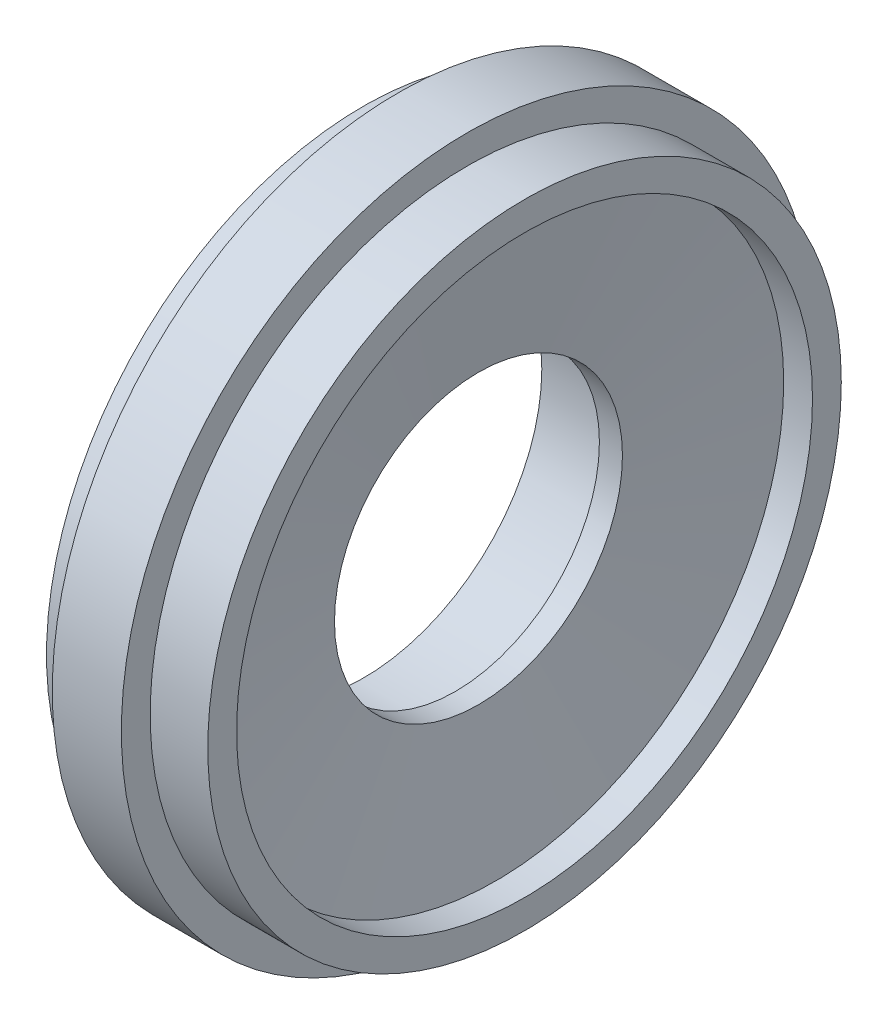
ISO-10303-21;
HEADER;
FILE_DESCRIPTION(('STEP AP214'),'2;1');
FILE_NAME('part.step','',(''),(''),'','','');
FILE_SCHEMA(('AUTOMOTIVE_DESIGN { 1 0 10303 214 1 1 1 1 }'));
ENDSEC;
DATA;
#1=APPLICATION_CONTEXT('core data for automotive mechanical design processes');
#2=APPLICATION_PROTOCOL_DEFINITION('international standard','automotive_design',2000,#1);
#3=PRODUCT_CONTEXT('',#1,'mechanical');
#4=PRODUCT('Part','Part','',(#3));
#5=PRODUCT_RELATED_PRODUCT_CATEGORY('part','',(#4));
#6=PRODUCT_DEFINITION_FORMATION('','',#4);
#7=PRODUCT_DEFINITION_CONTEXT('part definition',#1,'design');
#8=PRODUCT_DEFINITION('design','',#6,#7);
#9=PRODUCT_DEFINITION_SHAPE('','',#8);
#10=(LENGTH_UNIT() NAMED_UNIT(*) SI_UNIT(.MILLI.,.METRE.));
#11=(NAMED_UNIT(*) PLANE_ANGLE_UNIT() SI_UNIT($,.RADIAN.));
#12=(NAMED_UNIT(*) SI_UNIT($,.STERADIAN.) SOLID_ANGLE_UNIT());
#13=UNCERTAINTY_MEASURE_WITH_UNIT(LENGTH_MEASURE(1.E-05),#10,'distance_accuracy_value','');
#14=(GEOMETRIC_REPRESENTATION_CONTEXT(3) GLOBAL_UNCERTAINTY_ASSIGNED_CONTEXT((#13)) GLOBAL_UNIT_ASSIGNED_CONTEXT((#10,
#11,#12)) REPRESENTATION_CONTEXT('',''));
#15=CARTESIAN_POINT('',(0.,0.,0.));
#16=DIRECTION('',(0.,0.,1.));
#17=DIRECTION('',(1.,0.,0.));
#18=AXIS2_PLACEMENT_3D('',#15,#16,#17);
#19=CARTESIAN_POINT('',(16.,-21.6421009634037,0.));
#20=DIRECTION('',(-1.,0.,0.));
#21=DIRECTION('',(0.,0.,1.));
#22=AXIS2_PLACEMENT_3D('',#19,#20,#21);
#23=PLANE('',#22);
#24=CARTESIAN_POINT('',(16.,0.,0.));
#25=DIRECTION('',(1.,0.,0.));
#26=DIRECTION('',(0.,0.,-1.));
#27=AXIS2_PLACEMENT_3D('',#24,#25,#26);
#28=CIRCLE('',#27,25.);
#29=CARTESIAN_POINT('',(16.,0.,-25.));
#30=VERTEX_POINT('',#29);
#31=EDGE_CURVE('E10',#30,#30,#28,.T.);
#32=ORIENTED_EDGE('',*,*,#31,.T.);
#33=EDGE_LOOP('',(#32));
#34=FACE_BOUND('',#33,.T.);
#35=CARTESIAN_POINT('',(16.,0.,0.));
#36=DIRECTION('',(1.,0.,0.));
#37=DIRECTION('',(0.,0.,-1.));
#38=AXIS2_PLACEMENT_3D('',#35,#36,#37);
#39=CIRCLE('',#38,31.);
#40=CARTESIAN_POINT('',(16.,0.,-31.));
#41=VERTEX_POINT('',#40);
#42=EDGE_CURVE('E70',#41,#41,#39,.T.);
#43=ORIENTED_EDGE('',*,*,#42,.F.);
#44=EDGE_LOOP('',(#43));
#45=FACE_BOUND('',#44,.T.);
#46=ADVANCED_FACE('F30',(#34,#45),#23,.T.);
#47=CARTESIAN_POINT('',(56.9262114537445,0.,0.));
#48=DIRECTION('',(1.,0.,0.));
#49=DIRECTION('',(0.,0.,-1.));
#50=AXIS2_PLACEMENT_3D('',#47,#48,#49);
#51=CYLINDRICAL_SURFACE('',#50,25.);
#52=CARTESIAN_POINT('',(20.,0.,0.));
#53=DIRECTION('',(1.,0.,0.));
#54=DIRECTION('',(0.,0.,-1.));
#55=AXIS2_PLACEMENT_3D('',#52,#53,#54);
#56=CIRCLE('',#55,25.);
#57=CARTESIAN_POINT('',(20.,0.,-25.));
#58=VERTEX_POINT('',#57);
#59=EDGE_CURVE('E36',#58,#58,#56,.T.);
#60=ORIENTED_EDGE('',*,*,#59,.T.);
#61=EDGE_LOOP('',(#60));
#62=FACE_BOUND('',#61,.T.);
#63=ORIENTED_EDGE('',*,*,#31,.F.);
#64=EDGE_LOOP('',(#63));
#65=FACE_BOUND('',#64,.T.);
#66=ADVANCED_FACE('F78',(#62,#65),#51,.F.);
#67=CARTESIAN_POINT('',(23.,0.,0.));
#68=DIRECTION('',(1.,0.,0.));
#69=DIRECTION('',(0.,0.,-1.));
#70=AXIS2_PLACEMENT_3D('',#67,#68,#69);
#71=CONICAL_SURFACE('',#70,50.,1.45136740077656);
#72=ORIENTED_EDGE('',*,*,#59,.F.);
#73=EDGE_LOOP('',(#72));
#74=FACE_BOUND('',#73,.T.);
#75=CARTESIAN_POINT('',(23.,0.,0.));
#76=DIRECTION('',(1.,0.,0.));
#77=DIRECTION('',(0.,0.,-1.));
#78=AXIS2_PLACEMENT_3D('',#75,#76,#77);
#79=CIRCLE('',#78,50.);
#80=CARTESIAN_POINT('',(23.,0.,-50.));
#81=VERTEX_POINT('',#80);
#82=EDGE_CURVE('E40',#81,#81,#79,.T.);
#83=ORIENTED_EDGE('',*,*,#82,.T.);
#84=EDGE_LOOP('',(#83));
#85=FACE_BOUND('',#84,.T.);
#86=ADVANCED_FACE('F82',(#74,#85),#71,.F.);
#87=CARTESIAN_POINT('',(56.9262114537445,0.,0.));
#88=DIRECTION('',(1.,0.,0.));
#89=DIRECTION('',(0.,0.,-1.));
#90=AXIS2_PLACEMENT_3D('',#87,#88,#89);
#91=CYLINDRICAL_SURFACE('',#90,50.);
#92=ORIENTED_EDGE('',*,*,#82,.F.);
#93=EDGE_LOOP('',(#92));
#94=FACE_BOUND('',#93,.T.);
#95=CARTESIAN_POINT('',(28.,0.,0.));
#96=DIRECTION('',(1.,0.,0.));
#97=DIRECTION('',(0.,0.,-1.));
#98=AXIS2_PLACEMENT_3D('',#95,#96,#97);
#99=CIRCLE('',#98,50.);
#100=CARTESIAN_POINT('',(28.,0.,-50.));
#101=VERTEX_POINT('',#100);
#102=EDGE_CURVE('E44',#101,#101,#99,.T.);
#103=ORIENTED_EDGE('',*,*,#102,.T.);
#104=EDGE_LOOP('',(#103));
#105=FACE_BOUND('',#104,.T.);
#106=ADVANCED_FACE('F86',(#94,#105),#91,.F.);
#107=CARTESIAN_POINT('',(28.,-21.6421009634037,0.));
#108=DIRECTION('',(-1.,0.,0.));
#109=DIRECTION('',(0.,0.,1.));
#110=AXIS2_PLACEMENT_3D('',#107,#108,#109);
#111=PLANE('',#110);
#112=ORIENTED_EDGE('',*,*,#102,.F.);
#113=EDGE_LOOP('',(#112));
#114=FACE_BOUND('',#113,.T.);
#115=CARTESIAN_POINT('',(28.,0.,0.));
#116=DIRECTION('',(1.,0.,0.));
#117=DIRECTION('',(0.,0.,-1.));
#118=AXIS2_PLACEMENT_3D('',#115,#116,#117);
#119=CIRCLE('',#118,55.);
#120=CARTESIAN_POINT('',(28.,0.,-55.));
#121=VERTEX_POINT('',#120);
#122=EDGE_CURVE('E49',#121,#121,#119,.T.);
#123=ORIENTED_EDGE('',*,*,#122,.T.);
#124=EDGE_LOOP('',(#123));
#125=FACE_BOUND('',#124,.T.);
#126=ADVANCED_FACE('F93',(#114,#125),#111,.F.);
#127=CARTESIAN_POINT('',(56.9262114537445,0.,0.));
#128=DIRECTION('',(1.,0.,0.));
#129=DIRECTION('',(0.,0.,-1.));
#130=AXIS2_PLACEMENT_3D('',#127,#128,#129);
#131=CYLINDRICAL_SURFACE('',#130,55.);
#132=ORIENTED_EDGE('',*,*,#122,.F.);
#133=EDGE_LOOP('',(#132));
#134=FACE_BOUND('',#133,.T.);
#135=CARTESIAN_POINT('',(18.,0.,0.));
#136=DIRECTION('',(1.,0.,0.));
#137=DIRECTION('',(0.,0.,-1.));
#138=AXIS2_PLACEMENT_3D('',#135,#136,#137);
#139=CIRCLE('',#138,55.);
#140=CARTESIAN_POINT('',(18.,0.,-55.));
#141=VERTEX_POINT('',#140);
#142=EDGE_CURVE('E52',#141,#141,#139,.T.);
#143=ORIENTED_EDGE('',*,*,#142,.T.);
#144=EDGE_LOOP('',(#143));
#145=FACE_BOUND('',#144,.T.);
#146=ADVANCED_FACE('F97',(#134,#145),#131,.T.);
#147=CARTESIAN_POINT('',(18.,-21.6421009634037,0.));
#148=DIRECTION('',(-1.,0.,0.));
#149=DIRECTION('',(0.,0.,1.));
#150=AXIS2_PLACEMENT_3D('',#147,#148,#149);
#151=PLANE('',#150);
#152=ORIENTED_EDGE('',*,*,#142,.F.);
#153=EDGE_LOOP('',(#152));
#154=FACE_BOUND('',#153,.T.);
#155=CARTESIAN_POINT('',(18.,0.,0.));
#156=DIRECTION('',(1.,0.,0.));
#157=DIRECTION('',(0.,0.,-1.));
#158=AXIS2_PLACEMENT_3D('',#155,#156,#157);
#159=CIRCLE('',#158,60.);
#160=CARTESIAN_POINT('',(18.,0.,-60.));
#161=VERTEX_POINT('',#160);
#162=EDGE_CURVE('E55',#161,#161,#159,.T.);
#163=ORIENTED_EDGE('',*,*,#162,.T.);
#164=EDGE_LOOP('',(#163));
#165=FACE_BOUND('',#164,.T.);
#166=ADVANCED_FACE('F101',(#154,#165),#151,.F.);
#167=CARTESIAN_POINT('',(56.9262114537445,0.,0.));
#168=DIRECTION('',(1.,0.,0.));
#169=DIRECTION('',(0.,0.,-1.));
#170=AXIS2_PLACEMENT_3D('',#167,#168,#169);
#171=CYLINDRICAL_SURFACE('',#170,60.);
#172=ORIENTED_EDGE('',*,*,#162,.F.);
#173=EDGE_LOOP('',(#172));
#174=FACE_BOUND('',#173,.T.);
#175=CARTESIAN_POINT('',(6.,0.,0.));
#176=DIRECTION('',(1.,0.,0.));
#177=DIRECTION('',(0.,0.,-1.));
#178=AXIS2_PLACEMENT_3D('',#175,#176,#177);
#179=CIRCLE('',#178,60.);
#180=CARTESIAN_POINT('',(6.,0.,-60.));
#181=VERTEX_POINT('',#180);
#182=EDGE_CURVE('E58',#181,#181,#179,.T.);
#183=ORIENTED_EDGE('',*,*,#182,.T.);
#184=EDGE_LOOP('',(#183));
#185=FACE_BOUND('',#184,.T.);
#186=ADVANCED_FACE('F105',(#174,#185),#171,.T.);
#187=CARTESIAN_POINT('',(6.,-21.6421009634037,0.));
#188=DIRECTION('',(1.,0.,0.));
#189=DIRECTION('',(0.,0.,-1.));
#190=AXIS2_PLACEMENT_3D('',#187,#188,#189);
#191=PLANE('',#190);
#192=ORIENTED_EDGE('',*,*,#182,.F.);
#193=EDGE_LOOP('',(#192));
#194=FACE_BOUND('',#193,.T.);
#195=CARTESIAN_POINT('',(6.,0.,0.));
#196=DIRECTION('',(1.,0.,0.));
#197=DIRECTION('',(0.,0.,-1.));
#198=AXIS2_PLACEMENT_3D('',#195,#196,#197);
#199=CIRCLE('',#198,55.);
#200=CARTESIAN_POINT('',(6.,0.,-55.));
#201=VERTEX_POINT('',#200);
#202=EDGE_CURVE('E61',#201,#201,#199,.T.);
#203=ORIENTED_EDGE('',*,*,#202,.T.);
#204=EDGE_LOOP('',(#203));
#205=FACE_BOUND('',#204,.T.);
#206=ADVANCED_FACE('F109',(#194,#205),#191,.F.);
#207=CARTESIAN_POINT('',(56.9262114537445,0.,0.));
#208=DIRECTION('',(1.,0.,0.));
#209=DIRECTION('',(0.,0.,-1.));
#210=AXIS2_PLACEMENT_3D('',#207,#208,#209);
#211=CYLINDRICAL_SURFACE('',#210,55.);
#212=ORIENTED_EDGE('',*,*,#202,.F.);
#213=EDGE_LOOP('',(#212));
#214=FACE_BOUND('',#213,.T.);
#215=CARTESIAN_POINT('',(0.,0.,0.));
#216=DIRECTION('',(1.,0.,0.));
#217=DIRECTION('',(0.,0.,-1.));
#218=AXIS2_PLACEMENT_3D('',#215,#216,#217);
#219=CIRCLE('',#218,55.);
#220=CARTESIAN_POINT('',(0.,0.,-55.));
#221=VERTEX_POINT('',#220);
#222=EDGE_CURVE('E64',#221,#221,#219,.T.);
#223=ORIENTED_EDGE('',*,*,#222,.T.);
#224=EDGE_LOOP('',(#223));
#225=FACE_BOUND('',#224,.T.);
#226=ADVANCED_FACE('F113',(#214,#225),#211,.T.);
#227=CARTESIAN_POINT('',(0.,-21.6421009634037,0.));
#228=DIRECTION('',(1.,0.,0.));
#229=DIRECTION('',(0.,0.,-1.));
#230=AXIS2_PLACEMENT_3D('',#227,#228,#229);
#231=PLANE('',#230);
#232=ORIENTED_EDGE('',*,*,#222,.F.);
#233=EDGE_LOOP('',(#232));
#234=FACE_BOUND('',#233,.T.);
#235=CARTESIAN_POINT('',(0.,0.,0.));
#236=DIRECTION('',(1.,0.,0.));
#237=DIRECTION('',(0.,0.,-1.));
#238=AXIS2_PLACEMENT_3D('',#235,#236,#237);
#239=CIRCLE('',#238,31.);
#240=CARTESIAN_POINT('',(0.,0.,-31.));
#241=VERTEX_POINT('',#240);
#242=EDGE_CURVE('E67',#241,#241,#239,.T.);
#243=ORIENTED_EDGE('',*,*,#242,.T.);
#244=EDGE_LOOP('',(#243));
#245=FACE_BOUND('',#244,.T.);
#246=ADVANCED_FACE('F117',(#234,#245),#231,.F.);
#247=CARTESIAN_POINT('',(56.9262114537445,0.,0.));
#248=DIRECTION('',(1.,0.,0.));
#249=DIRECTION('',(0.,0.,-1.));
#250=AXIS2_PLACEMENT_3D('',#247,#248,#249);
#251=CYLINDRICAL_SURFACE('',#250,31.);
#252=ORIENTED_EDGE('',*,*,#42,.T.);
#253=EDGE_LOOP('',(#252));
#254=FACE_BOUND('',#253,.T.);
#255=ORIENTED_EDGE('',*,*,#242,.F.);
#256=EDGE_LOOP('',(#255));
#257=FACE_BOUND('',#256,.T.);
#258=ADVANCED_FACE('F74',(#254,#257),#251,.F.);
#259=CLOSED_SHELL('',(#46,#66,#86,#106,#126,#146,#166,#186,#206,#226,#246,#258));
#260=MANIFOLD_SOLID_BREP('B2',#259);
#261=ADVANCED_BREP_SHAPE_REPRESENTATION('',(#18,#260),#14);
#262=SHAPE_DEFINITION_REPRESENTATION(#9,#261);
ENDSEC;
END-ISO-10303-21;
